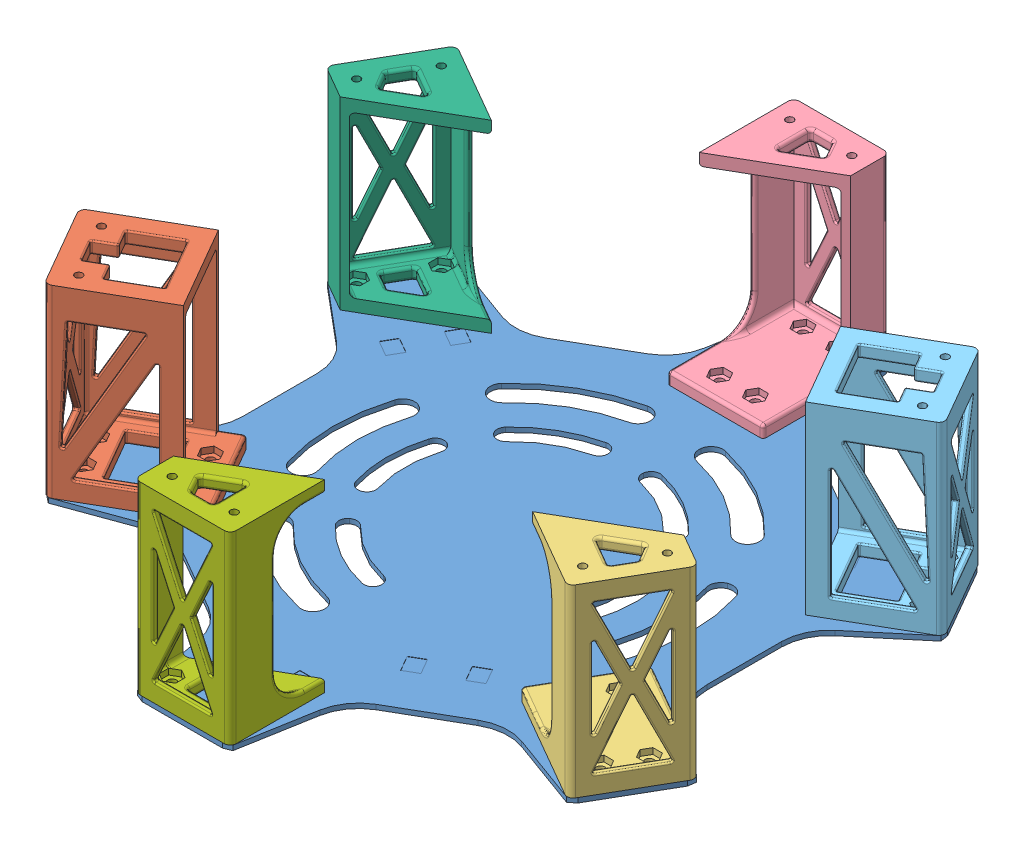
SolidWorks assembly Assem4.sldasm, configuration Default (file format 10000). Lengths in mm.
Overall size (207.92 63.6 221.5).
7 component instances, 7 part files, 18 mates.
Components (placement in the parent):
- Center_board_bottom-1: Center_board_bottom.SLDPRT [Default] at (34.5115 68.4912 210.4522) x (0 0 1) z (-1 0 0) size (221.5 50 206.09)
- Spacer_long_base_square-1: Spacer_long_base_square.SLDPRT [Default] at (-23.6895 70.0912 262.6452) x (-0.5 0 -0.866025) z (0.866025 0 -0.5) size (32.2 62 41.25)
- Spacer_long_base_triangular-1: Spacer_long_base_triangular.SLDPRT [Default] at (108.8124 70.0912 234.7592) x (-0.5 0 0.866025) z (-0.866025 0 -0.5) size (32.2 62 42.48)
- Spacer_long_base_triangular_MIRROR-1: Spacer_long_base_triangular_MIRROR.SLDPRT [Default] at (-13.7885 70.0912 133.9522) size (58.73 62 42.48)
- Spacer_short_base_square-1: Spacer_short_base_square.SLDPRT [Default] at (92.7124 70.0912 158.2592) x (0.5 0 0.866025) z (-0.866025 0 0.5) size (32.2 62 34.25)
- Spacer_short_base_triangular-1: Spacer_short_base_triangular.SLDPRT [Default] at (-39.7895 70.0912 186.1452) x (0.5 0 -0.866025) z (0.866025 0 0.5) size (32.2 62 34.25)
- Spacer_short_base_triangular_MIRROR-1: Spacer_short_base_triangular_MIRROR.SLDPRT [Default] at (82.8115 70.0912 286.9522) x (-1 0 0) z (0 0 -1) size (58.73 62 34.25)
Mates (geometry in assembly coordinates):
- Concentric1: concentric aligned: cylinder of Center_board_bottom-1 through (24.0815 70.0912 314.2022) axis (0 1 0) radius 1.45; cylinder of Spacer_short_base_triangular_MIRROR-1 through (24.0815 64.0912 314.2022) axis (0 1 0) radius 1.5
- Coincident1: coincident aligned: plane of Center_board_bottom-1 through (34.5115 70.0912 321.2022) normal (0 0 1); plane of Spacer_short_base_triangular_MIRROR-1 through (18.4115 74.0912 321.2022) normal (0 0 1)
- Coincident2: coincident anti-aligned: plane of Center_board_bottom-1 through (34.5115 70.0912 210.4522) normal (0 1 0); plane of Spacer_short_base_triangular_MIRROR-1 through (82.8115 70.0912 286.9522) normal (0 -1 0)
- Coincident7: coincident: plane of Center_board_bottom-1 through (130.4238 70.0912 265.8272) normal (0.866025 0 0.5); plane of Spacer_long_base_triangular-1 through (138.4738 74.0912 251.8842) normal (0.866025 0 0.5)
- Coincident8: coincident: plane of Center_board_bottom-1 through (34.5115 70.0912 210.4522) normal (0 1 0); plane of Spacer_long_base_triangular-1 through (108.8124 70.0912 234.7592) normal (0 -1 0)
- Coincident9: coincident: moEndPointRef_w of Center_board_bottom-1; moEndPointRef_w of Spacer_long_base_triangular-1
- Concentric3: concentric: cylinder of Center_board_bottom-1 through (129.5766 70.0912 167.6099) axis (0 1 0) radius 1.45; cylinder of Spacer_short_base_square-1 through (129.5766 64.0912 167.6099) axis (0 1 0) radius 1.5
- Coincident10: coincident: plane of Center_board_bottom-1 through (130.4238 70.0912 155.0772) normal (0.866025 0 -0.5); plane of Spacer_short_base_square-1 through (122.3738 74.0912 141.1342) normal (0.866025 0 -0.5)
- Coincident11: coincident anti-aligned: plane of Center_board_bottom-1 through (34.5115 70.0912 210.4522) normal (0 1 0); plane of Spacer_short_base_square-1 through (92.7124 70.0912 158.2592) normal (0 -1 0)
- Coincident12: coincident: plane of Center_board_bottom-1 through (-61.4008 70.0912 265.8272) normal (-0.866025 0 0.5); plane of Spacer_long_base_square-1 through (-53.3508 74.0912 279.7702) normal (-0.866025 0 0.5)
- Coincident13: coincident: plane of Center_board_bottom-1 through (34.5115 70.0912 210.4522) normal (0 1 0); plane of Spacer_long_base_square-1 through (-23.6895 70.0912 262.6452) normal (0 -1 0)
- Coincident14: coincident: moEndPointRef_w of Center_board_bottom-1; point of Spacer_long_base_square-1
- Concentric4: concentric: cylinder of Center_board_bottom-1 through (-50.1237 70.0912 149.5446) axis (0 1 0) radius 1.45; cylinder of Spacer_short_base_triangular-1 through (-50.1237 64.0912 149.5446) axis (0 1 0) radius 1.5
- Coincident15: coincident: plane of Center_board_bottom-1 through (-61.4008 70.0912 155.0772) normal (-0.866025 0 -0.5); plane of Spacer_short_base_triangular-1 through (-69.4508 74.0912 169.0202) normal (-0.866025 0 -0.5)
- Coincident16: coincident anti-aligned: plane of Center_board_bottom-1 through (34.5115 70.0912 210.4522) normal (0 1 0); plane of Spacer_short_base_triangular-1 through (-39.7895 70.0912 186.1452) normal (0 -1 0)
- Coincident17: coincident: plane of Center_board_bottom-1 through (34.5115 70.0912 99.7022) normal (0 0 -1); plane of Spacer_long_base_triangular_MIRROR-1 through (50.6115 74.0912 99.7022) normal (0 0 -1)
- Coincident18: coincident: plane of Center_board_bottom-1 through (34.5115 70.0912 210.4522) normal (0 1 0); plane of Spacer_long_base_triangular_MIRROR-1 through (-13.7885 70.0912 133.9522) normal (0 -1 0)
- Coincident19: coincident: moEndPointRef_w of Center_board_bottom-1; moEndPointRef_w of Spacer_long_base_triangular_MIRROR-1
